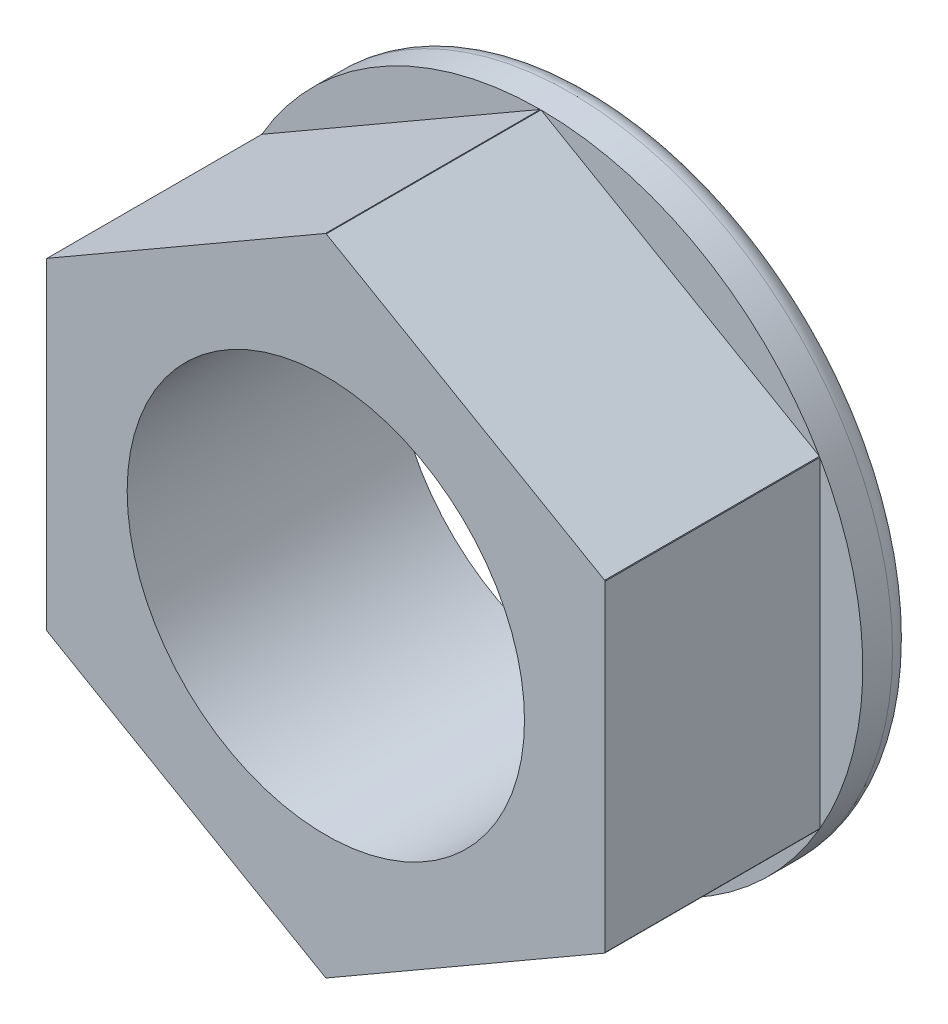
from build123d import *

# Parameters (mm, degrees)
SKETCH1_R          = 11.90625
SKETCH1_R_2        = 7.34187
NUT_DEPTH          = 9.8298
SKETCH3_OUTSIDE_W  = 32.828
SKETCH3_OUTSIDE_H  = 32.828
CUT_EXTRUDE1_DEPTH = 7.9375
FILLET1_R          = 0.79375


with BuildPart() as part:
    # Sketch1 → Nut (new body)
    with BuildSketch(Plane.XY):
        Circle(SKETCH1_R)
        Circle(SKETCH1_R_2, mode=Mode.SUBTRACT)
    extrude(amount=NUT_DEPTH)

    # Sketch3 outside → Cut-Extrude1 (cut)
    with BuildSketch(Plane.XY.offset(9.8298)):
        Rectangle(SKETCH3_OUTSIDE_W, SKETCH3_OUTSIDE_H)
        Polygon((0, 11.91506618), (-10.31875, 5.95753309), (-10.31875, -5.95753309), (0, -11.91506618), (10.31875, -5.95753309), (10.31875, 5.95753309), align=None, mode=Mode.SUBTRACT)
    extrude(amount=-CUT_EXTRUDE1_DEPTH, mode=Mode.SUBTRACT)

    # Fillet1
    fillet1_edges = [part.edges().sort_by_distance(p)[0] for p in [
        (-11.90625, 0, 0),
    ]]
    fillet(fillet1_edges, radius=FILLET1_R)


solid = part.part
